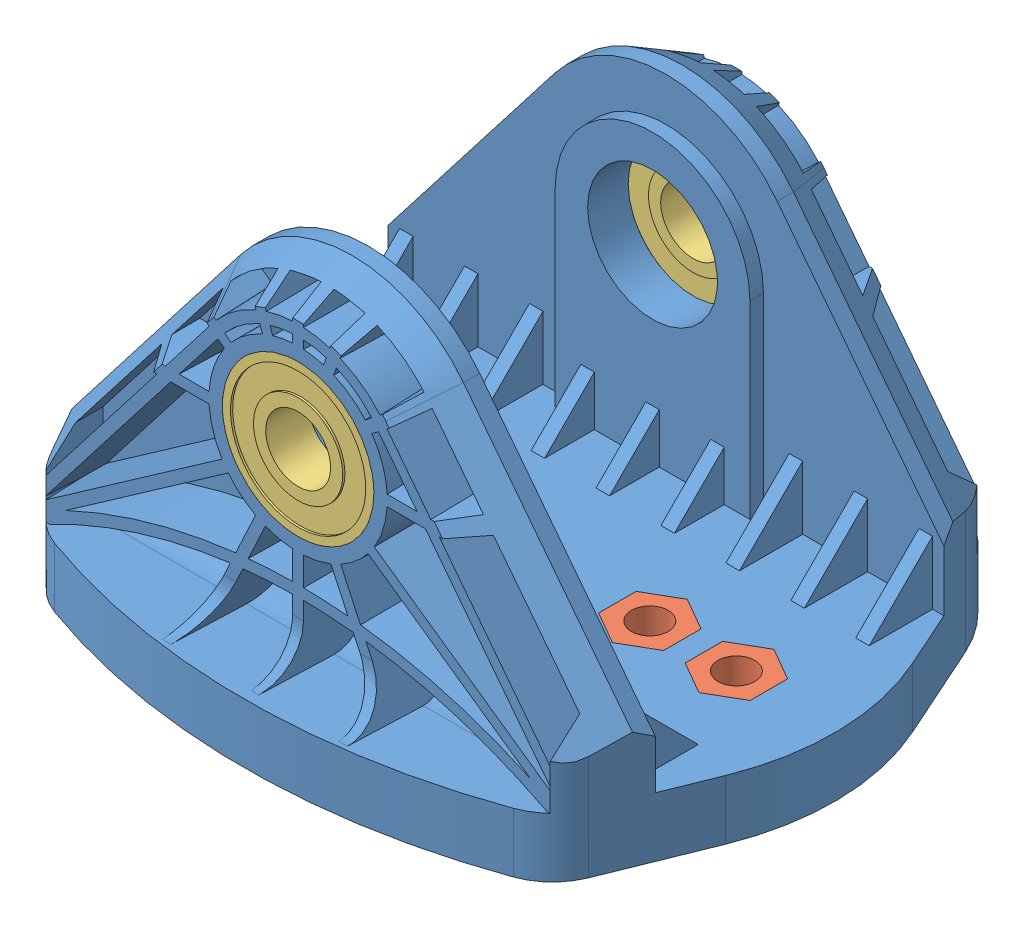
SolidWorks assembly Truck Assembly_&.SLDASM, configuration Default (file format 5000). Lengths in mm.
Overall size (120 72 100).
7 component instances, 3 part files, 16 mates.
Components (placement in the parent):
- Truck_&-1: Truck_&.SLDPRT [Default] at origin size (120 72 100)
- 8mm Threaded Insert_&-1: 8mm Threaded Insert_&.SLDPRT [Default] at (-41 0.586 0) x (0.866025 0 0.5) z (-0.5 0 0.866025) size (13.86 10.41 12)
- 8mm Threaded Insert_&-2: 8mm Threaded Insert_&.SLDPRT [Default] at (41 0.586 0) x (0.866025 0 0.5) z (-0.5 0 0.866025) size (13.86 10.41 12)
- 8mm Threaded Insert_&-3: 8mm Threaded Insert_&.SLDPRT [Default] at (25 0.586 0) x (0.866025 0 0.5) z (-0.5 0 0.866025) size (13.86 10.41 12)
- 8mm Threaded Insert_&-4: 8mm Threaded Insert_&.SLDPRT [Default] at (-25 0.586 0) x (0.866025 0 0.5) z (-0.5 0 0.866025) size (13.86 10.41 12)
- Bearing_&-1: Bearing_&.SLDPRT [28mm OD X 12mm ID] at (0 46 36) x (0.923728 0.383049 0) z (0 0 -1) size (28 28 8)
- Bearing_&-2: Bearing_&.SLDPRT [28mm OD X 12mm ID] at (0 46 -37) size (28 28 8)
Mates (geometry in assembly coordinates):
- Coincident1: coincident: plane of Truck_&-1 through (-47 0 -3.4641) normal (1 0 0); plane of 8mm Threaded Insert_&-1 through (-47 11 -3.4641) normal (-1 0 0)
- Coincident2: coincident: plane of Truck_&-1 through (-47 0 3.4641) normal (0.5 0 -0.866025); plane of 8mm Threaded Insert_&-1 through (-47 11 3.4641) normal (-0.5 0 0.866025)
- Coincident3: coincident aligned: plane of Truck_&-1 through (60 11 27) normal (0 1 0); plane of 8mm Threaded Insert_&-1 through (-35 11 3.4641) normal (0 1 0)
- Coincident4: coincident: plane of Truck_&-1 through (-31 0 -3.4641) normal (1 0 0); plane of 8mm Threaded Insert_&-4 through (-31 11 -3.4641) normal (-1 0 0)
- Coincident5: coincident: plane of Truck_&-1 through (-31 0 3.4641) normal (0.5 0 -0.866025); plane of 8mm Threaded Insert_&-4 through (-31 11 3.4641) normal (-0.5 0 0.866025)
- Coincident6: coincident aligned: plane of Truck_&-1 through (60 11 27) normal (0 1 0); plane of 8mm Threaded Insert_&-4 through (-19 11 3.4641) normal (0 1 0)
- Coincident7: coincident: plane of Truck_&-1 through (19 0 3.4641) normal (1 0 0); plane of 8mm Threaded Insert_&-3 through (19 11 -3.4641) normal (-1 0 0)
- Coincident8: coincident: plane of Truck_&-1 through (25 0 6.9282) normal (0.5 0 -0.866025); plane of 8mm Threaded Insert_&-3 through (19 11 3.4641) normal (-0.5 0 0.866025)
- Coincident9: coincident aligned: plane of Truck_&-1 through (60 11 27) normal (0 1 0); plane of 8mm Threaded Insert_&-3 through (31 11 3.4641) normal (0 1 0)
- Coincident10: coincident: plane of Truck_&-1 through (35 0 3.4641) normal (1 0 0); plane of 8mm Threaded Insert_&-2 through (35 11 -3.4641) normal (-1 0 0)
- Coincident11: coincident: plane of Truck_&-1 through (41 0 6.9282) normal (0.5 0 -0.866025); plane of 8mm Threaded Insert_&-2 through (35 11 3.4641) normal (-0.5 0 0.866025)
- Coincident12: coincident aligned: plane of Truck_&-1 through (60 11 27) normal (0 1 0); plane of 8mm Threaded Insert_&-2 through (47 11 3.4641) normal (0 1 0)
- Concentric11: concentric: cylinder of Truck_&-1 through (0 46 50) axis (0 0 -1) radius 12; cylinder of Bearing_&-1 through (-22.5947 32.4372 23.158) axis (0 0 -1) radius 14
- Coincident131: coincident: plane of Truck_&-1 through (0 46 32) normal (0 0 1); plane of Bearing_&-1 through (-22.5947 32.4372 23.158) normal (0 0 1)
- Concentric21: concentric: cylinder of Truck_&-1 through (0 46 50) axis (0 0 -1) radius 12; cylinder of Bearing_&-2 through (16.3991 31.2189 -20.6123) axis (0 0 -1) radius 14
- Coincident141: coincident: plane of Truck_&-1 through (0 46 -33) normal (0 0 -1); plane of Bearing_&-2 through (16.3991 31.2189 -20.6123) normal (0 0 1)
